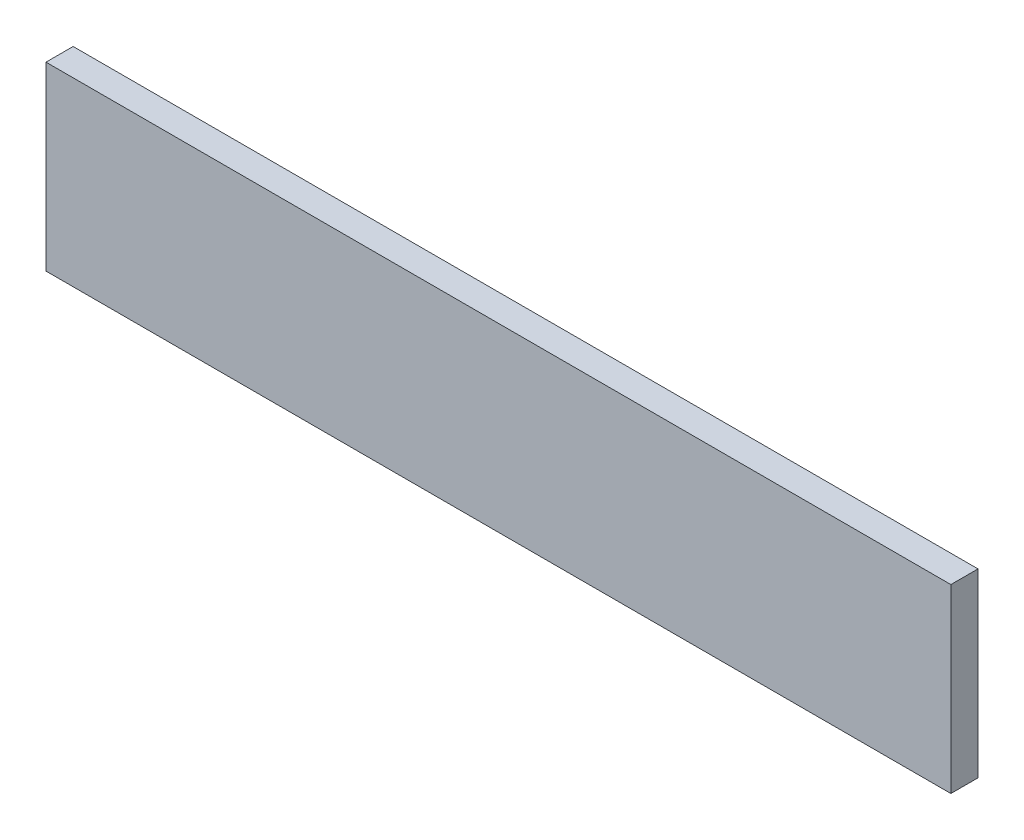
from build123d import *

# Parameters (mm, degrees)
ESQUISSE1_W        = 200
ESQUISSE1_H        = 40
BOSS_EXTRU_1_DEPTH = 6


with BuildPart() as part:
    # Esquisse1 → Boss.-Extru.1 (new body)
    with BuildSketch(Plane.XY):
        Rectangle(ESQUISSE1_W, ESQUISSE1_H)
    extrude(amount=BOSS_EXTRU_1_DEPTH)


solid = part.part
